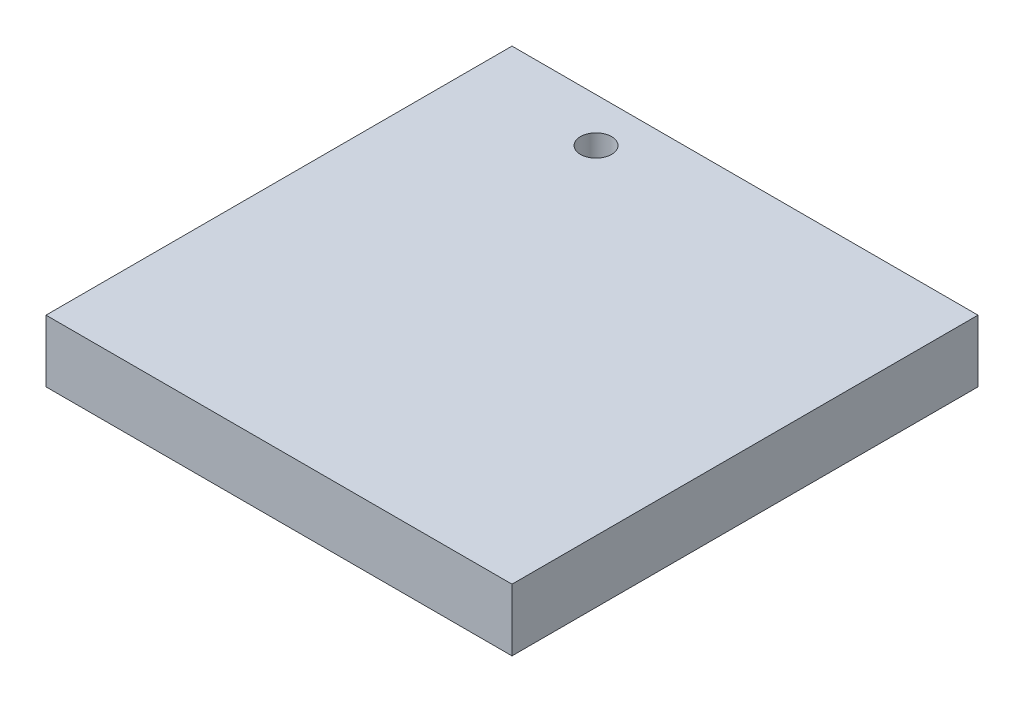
from build123d import *

# Parameters (mm, degrees)
SKETCH1_W          = 150
SKETCH1_H          = 150
EXTRUDE1_DEPTH     = 20
SKETCH2_R          = 5
CUT_EXTRUDE1_DEPTH = 10


with BuildPart() as part:
    # Sketch1 → Extrude1 (new body)
    with BuildSketch(Plane(origin=(0, 0, 0), x_dir=(1, 0, 0), z_dir=(0, 1, 0))):
        Rectangle(SKETCH1_W, SKETCH1_H)
    extrude(amount=EXTRUDE1_DEPTH)

    # Sketch2 → Cut-Extrude1 (cut)
    with BuildSketch(Plane(origin=(0, 20, 0), x_dir=(-1, 0, 0), z_dir=(0, 1, 0))):
        with Locations(Location((33.76, -60.81, 0), (0, 0, 90))):
            Circle(SKETCH2_R)
    extrude(amount=-CUT_EXTRUDE1_DEPTH, mode=Mode.SUBTRACT)


solid = part.part
